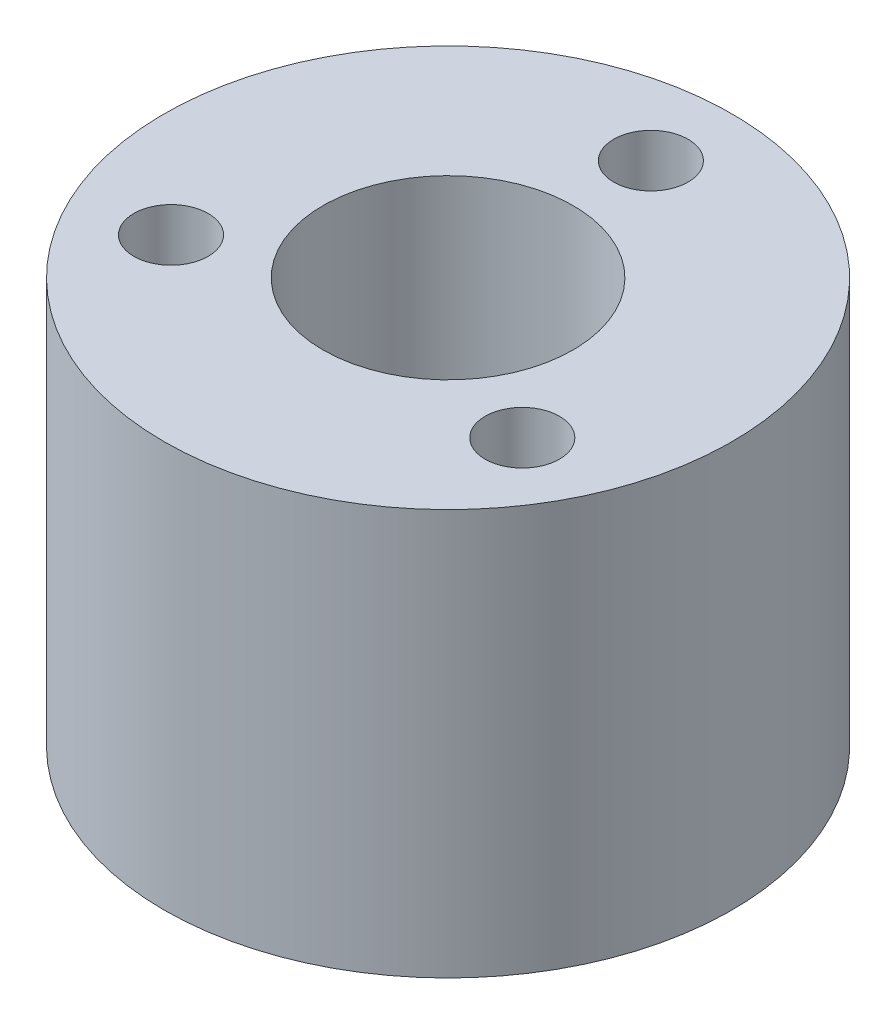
from build123d import *

# Parameters (mm, degrees)
SKETCH2_R              = 21
BOSS_EXTRUDE1_DEPTH    = 15
M20X1_5_TAPPED_HOLE1_D = 18.5
M5_CLEARANCE_HOLE1_D   = 5.5
CIRPATTERN2_COUNT      = 3


with BuildPart() as part:
    # Sketch2 → Boss-Extrude1 (new, symmetric)
    with BuildSketch(Plane(origin=(0, 0, 0), x_dir=(1, 0, 0), z_dir=(0, 1, 0))):
        with Locations(Location((0, 0, 0), (0, 0, 270))):
            Circle(SKETCH2_R)
    extrude(amount=BOSS_EXTRUDE1_DEPTH, both=True)

    # M20x1.5 Tapped Hole1 (through all)
    with Locations(Plane(origin=(0, 15, 0), x_dir=(1, 0, 0), z_dir=(0, 1, 0))):
        with Locations((0, 0)):
            Hole(M20X1_5_TAPPED_HOLE1_D / 2)

    # M5 Clearance Hole1 (through all)
    with Locations(Plane(origin=(0, 15, 0), x_dir=(1, 0, 0), z_dir=(0, 1, 0))):
        with Locations((0, 15)):
            m5_clearance_hole1 = Hole(M5_CLEARANCE_HOLE1_D / 2)

    # CirPattern2: M5 Clearance Hole1 ×3 about axis
    cirpattern2_axis = Axis((0, 0, 0), (0, 1, 0))
    for i in range(1, CIRPATTERN2_COUNT):
        add(m5_clearance_hole1.rotate(cirpattern2_axis, i * 360 / CIRPATTERN2_COUNT), mode=Mode.SUBTRACT)


solid = part.part
